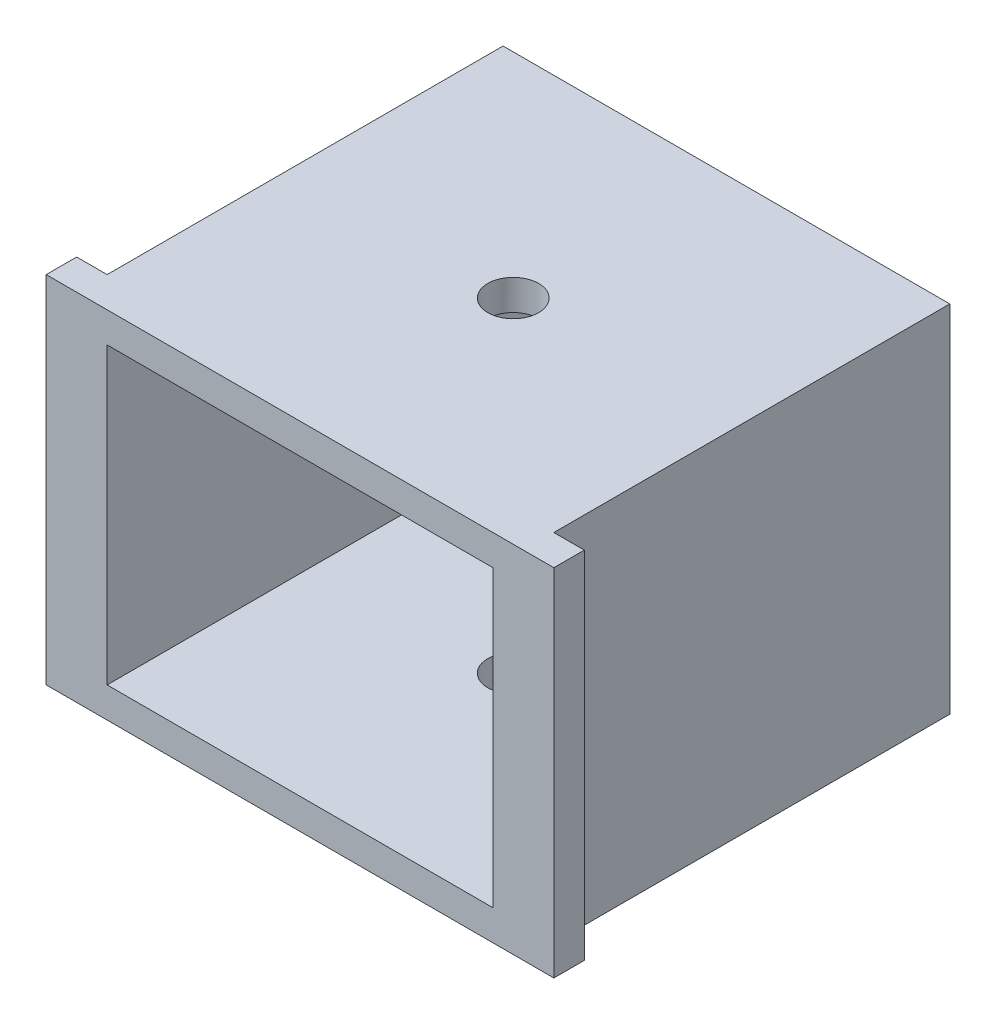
from build123d import *

# Parameters (mm, degrees)
CROQUIS1_W                        = 50
CROQUIS1_H                        = 42
SALIENTE_EXTRUIR1_DEPTH           = 35
CROQUIS2_W                        = 3
CROQUIS2_H                        = 39
CORTAR_EXTRUIR1_DEPTH             = 75.087785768
CROQUIS3_W                        = 3
CROQUIS3_H                        = 39
CORTAR_EXTRUIR2_DEPTH             = 75.087785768
CROQUIS4_W                        = 38
CROQUIS4_H                        = 29
CORTAR_EXTRUIR3_DEPTH             = 75.087785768
DI_METRO_DE_TALADRO_5_0_5_1_D     = 5
DI_METRO_DE_TALADRO_5_0_5_1_DEPTH = 3
DI_METRO_DE_TALADRO_5_0_5_2_D     = 5


with BuildPart() as part:
    # Croquis1 → Saliente-Extruir1 (new body)
    with BuildSketch(Plane.XZ):
        with Locations((25, 21)):
            Rectangle(CROQUIS1_W, CROQUIS1_H)
    extrude(amount=-SALIENTE_EXTRUIR1_DEPTH)

    # Croquis2 → Cortar-Extruir1 (cut, through all)
    with BuildSketch(Plane(origin=(0, 35, 0), x_dir=(-1, 0, 0), z_dir=(0, 1, 0))):
        with Locations((-48.5, 19.5)):
            Rectangle(CROQUIS2_W, CROQUIS2_H)
    extrude(amount=-CORTAR_EXTRUIR1_DEPTH, mode=Mode.SUBTRACT)

    # Croquis3 → Cortar-Extruir2 (cut, through all)
    with BuildSketch(Plane(origin=(0, 35, 0), x_dir=(-1, 0, 0), z_dir=(0, 1, 0))):
        with Locations((-1.5, 19.5)):
            Rectangle(CROQUIS3_W, CROQUIS3_H)
    extrude(amount=-CORTAR_EXTRUIR2_DEPTH, mode=Mode.SUBTRACT)

    # Croquis4 → Cortar-Extruir3 (cut, through all)
    with BuildSketch(Plane(origin=(0, 0, 0), x_dir=(-1, 0, 0), z_dir=(0, 0, -1))):
        with Locations((-25, 17.5)):
            Rectangle(CROQUIS4_W, CROQUIS4_H)
    extrude(amount=-CORTAR_EXTRUIR3_DEPTH, mode=Mode.SUBTRACT)

    # Di_metro de taladro _5.0 _5_1
    with Locations(Plane(origin=(0, 35, 0), x_dir=(1, 0, 0), z_dir=(0, 1, 0))):
        with Locations((25, -21)):
            Hole(DI_METRO_DE_TALADRO_5_0_5_1_D / 2, depth=DI_METRO_DE_TALADRO_5_0_5_1_DEPTH)

    # Di_metro de taladro _5.0 _5_2 (through all)
    with Locations(Plane(origin=(0, 0, 0), x_dir=(-1, 0, 0), z_dir=(0, -1, 0))):
        with Locations((-25, -21)):
            Hole(DI_METRO_DE_TALADRO_5_0_5_2_D / 2)


solid = part.part
